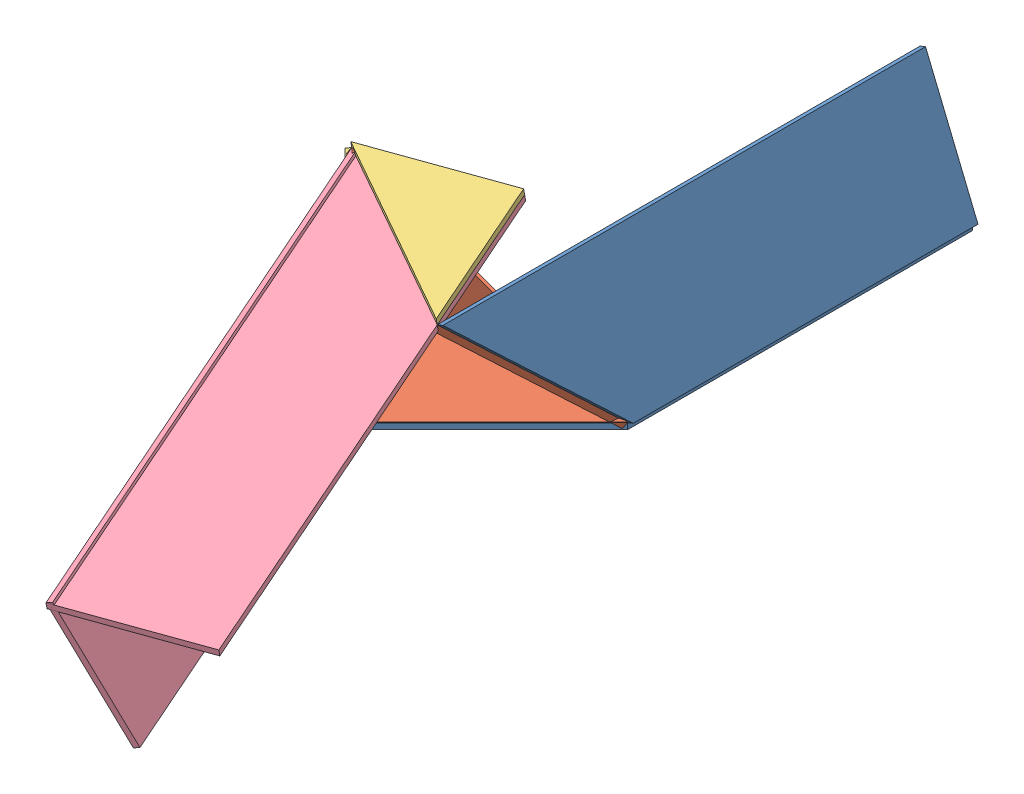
SolidWorks assembly Assemfolded.SLDASM, configuration Default (file format 14000). Lengths in mm.
Overall size (51.82 46.44 141.02).
8 component instances, 4 part files, 18 mates.
Components (placement in the parent):
- Boss-Extrude2-1: Boss-Extrude2.SLDPRT [Default] at (6.7823 44.795 209.5172) size (23 1 80.5)
- Boss-Extrude3-1: Boss-Extrude3.SLDPRT [Default] at (-77.2034 103.0562 125.5316) x (0.183258 0.547128 -0.816742) z (-0.816742 0.547128 0.183258) size (23 1 46)
- Boss-Extrude5-1: Boss-Extrude5.SLDPRT [Default] at (-25.0941 66.1487 9.6695) x (-0.334135 0.893725 0.299349) z (-0.299349 0.200531 -0.932833) size (23 1 23)
- Boss-Extrude6-1: Boss-Extrude6.SLDPRT [Default] at (24.8885 34.6658 159.4546) x (-0.334135 0.893725 0.299349) z (0.299349 -0.200531 0.932833) size (23 1 80.5)
- Boss-Extrude2-2: Boss-Extrude2.SLDPRT [Default] at (21.0308 67.065 209.5172) x (0.380497 -0.924782 0) z (0 0 1) size (23 1 80.5)
- Boss-Extrude3-2: Boss-Extrude3.SLDPRT [Default] at (-63.502 123.6928 124.9844) x (-0.436245 -0.377654 -0.816742) z (-0.816742 0.547128 0.183258) size (23 1 46)
- Boss-Extrude5-2: Boss-Extrude5.SLDPRT [Default] at (-9.9518 87.82 9.469) x (-0.953638 -0.031057 0.299349) z (-0.299349 0.200531 -0.932833) size (23 1 23)
- Boss-Extrude6-2: Boss-Extrude6.SLDPRT [Default] at (16.2786 53.841 166.3396) x (0.953638 0.031057 -0.299349) z (0.299349 -0.200531 0.932833) size (23 1 80.5)
Mates (geometry in assembly coordinates):
- Coincident1: coincident: point of Boss-Extrude2-1; point of Boss-Extrude3-1
- Coincident2: coincident: point of Boss-Extrude2-1; point of Boss-Extrude3-1
- Coincident3: coincident: point of Boss-Extrude3-1; point of Boss-Extrude5-1
- Coincident4: coincident: point of Boss-Extrude3-1; point of Boss-Extrude5-1
- Coincident5: coincident: point of Boss-Extrude3-1; point of Boss-Extrude6-1
- Coincident7: coincident: point of Boss-Extrude5-1; point of Boss-Extrude6-1
- Coincident8: coincident: point of Boss-Extrude2-1; point of Boss-Extrude2-2
- Coincident9: coincident: point of Boss-Extrude2-1; point of Boss-Extrude2-2
- Coincident10: coincident: point of Boss-Extrude2-2; point of Boss-Extrude3-2
- Coincident11: coincident: point of Boss-Extrude2-2; point of Boss-Extrude3-2
- Coincident12: coincident: point of Boss-Extrude5-1; point of Boss-Extrude3-2
- Coincident13: coincident: point of Boss-Extrude5-1; point of Boss-Extrude5-2
- Coincident14: coincident: point of Boss-Extrude3-2; point of Boss-Extrude5-2
- Coincident15: coincident: point of Boss-Extrude6-1; point of Boss-Extrude6-2
- Coincident16: coincident: point of Boss-Extrude5-2; point of Boss-Extrude6-2
- Coincident17: coincident: point of Boss-Extrude6-1; point of Boss-Extrude6-2
- Parallel1: parallel aligned: plane of Boss-Extrude5-2 through (-9.9207 88.7992 9.6695) normal (0.031057 0.979195 0.200531); plane of Boss-Extrude6-2 through (16.3097 54.8202 166.5402) normal (0.031057 0.979195 0.200531)
- Parallel2: parallel aligned: plane of Boss-Extrude5-1 through (-25.0941 66.1487 9.6695) normal (-0.893725 -0.401302 0.200531); plane of Boss-Extrude6-1 through (23.9948 34.2645 159.6551) normal (-0.893725 -0.401302 0.200531)
